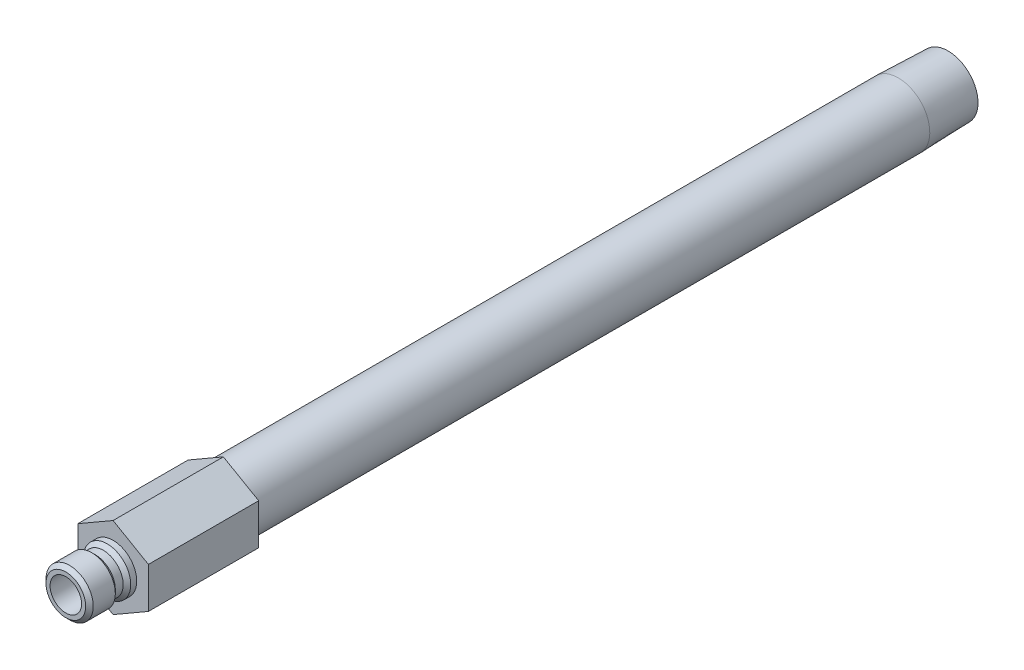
from build123d import *

# Parameters (mm, degrees)
SKETCH2_R           = 3.175
BOSS_EXTRUDE1_DEPTH = 22.225


with BuildPart() as part:
    # Sketch1 → Revolve1 (revolve)
    with BuildSketch(Plane(origin=(0, 0, 0), x_dir=(0, 0, -1), z_dir=(1, 0, 0))):
        Polygon((-9.525, 3.175), (-9.525, 4.0005), (-8.763, 4.7625), (-4.318, 4.7625), (-3.556, 4.0005), (-1.9685, 4.0005), (-1.2065, 4.7625), (0, 4.7625), (0, 6.35), (158.242, 6.35), (168.275, 6.036470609), (168.275, 4.6228), (22.225, 4.6228), (22.225, 3.175), align=None)
    revolve(axis=Axis((0, 0, 0), (0, 0, 1)))

    # Sketch2 → Boss-Extrude1 (add)
    with BuildSketch(Plane.XY):
        Polygon((-7.112, 4.106115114), (-7.112, -4.106115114), (0, -8.212230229), (7.112, -4.106115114), (7.112, 4.106115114), (0, 8.212230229), align=None)
        with Locations(Location((0, 0, 0), (0, 0, 90))):
            Circle(SKETCH2_R, mode=Mode.SUBTRACT)
    extrude(amount=-BOSS_EXTRUDE1_DEPTH)


solid = part.part
